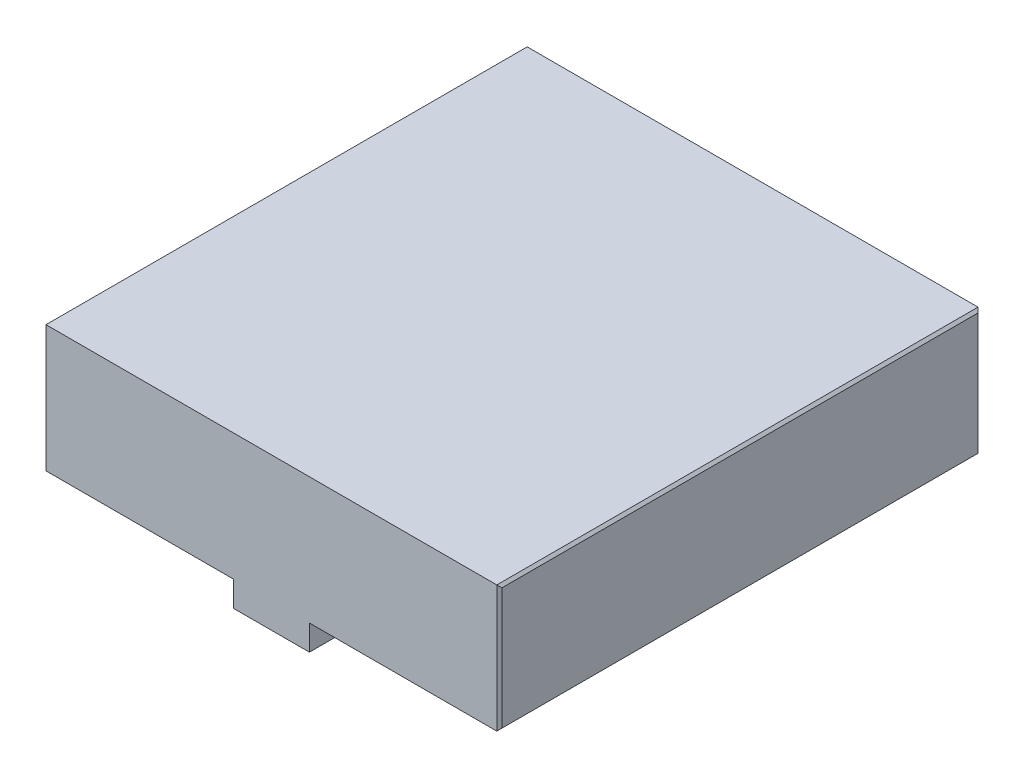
from build123d import *

# Parameters (mm, degrees)
EXTRUSION1_DEPTH = 95
CHANFREIN1_SIZE  = 0.5


with BuildPart() as part:
    # Esquisse1 → Extrusion1 (new body)
    with BuildSketch(Plane.XY):
        Polygon((-7.5, 0), (7.5, 0), (7.5, 5), (45, 5), (45, 30), (-45, 30), (-45, 5), (-7.5, 5), align=None)
    extrude(amount=EXTRUSION1_DEPTH)

    # Chanfrein1
    chanfrein1_edges = [part.edges().sort_by_distance(p)[0] for p in [
        (-45, 5, 47.5),
        (-45, 30, 47.5),
        (45, 30, 47.5),
        (45, 5, 47.5),
        (45, 17.5, 95),
        (-45, 17.5, 95),
        (-45, 17.5, 0),
        (45, 17.5, 0),
    ]]
    chamfer(chanfrein1_edges, length=CHANFREIN1_SIZE)


solid = part.part
